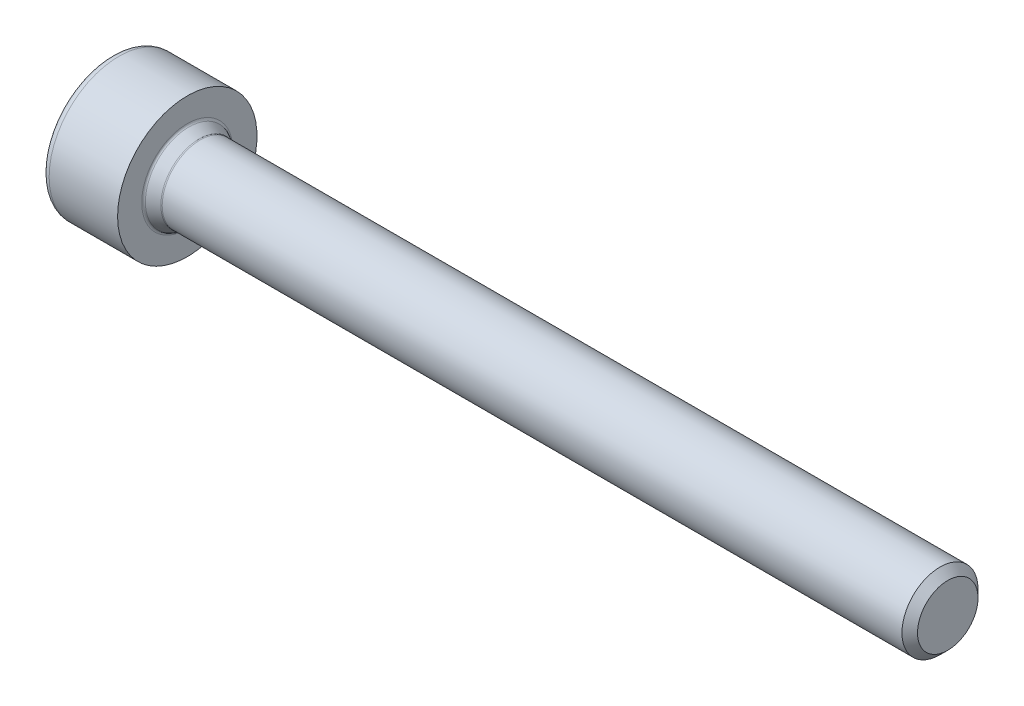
ISO-10303-21;
HEADER;
FILE_DESCRIPTION(('STEP AP214'),'2;1');
FILE_NAME('part.step','',(''),(''),'','','');
FILE_SCHEMA(('AUTOMOTIVE_DESIGN { 1 0 10303 214 1 1 1 1 }'));
ENDSEC;
DATA;
#1=APPLICATION_CONTEXT('core data for automotive mechanical design processes');
#2=APPLICATION_PROTOCOL_DEFINITION('international standard','automotive_design',2000,#1);
#3=PRODUCT_CONTEXT('',#1,'mechanical');
#4=PRODUCT('Part','Part','',(#3));
#5=PRODUCT_RELATED_PRODUCT_CATEGORY('part','',(#4));
#6=PRODUCT_DEFINITION_FORMATION('','',#4);
#7=PRODUCT_DEFINITION_CONTEXT('part definition',#1,'design');
#8=PRODUCT_DEFINITION('design','',#6,#7);
#9=PRODUCT_DEFINITION_SHAPE('','',#8);
#10=(LENGTH_UNIT() NAMED_UNIT(*) SI_UNIT(.MILLI.,.METRE.));
#11=(NAMED_UNIT(*) PLANE_ANGLE_UNIT() SI_UNIT($,.RADIAN.));
#12=(NAMED_UNIT(*) SI_UNIT($,.STERADIAN.) SOLID_ANGLE_UNIT());
#13=UNCERTAINTY_MEASURE_WITH_UNIT(LENGTH_MEASURE(1.E-05),#10,'distance_accuracy_value','');
#14=(GEOMETRIC_REPRESENTATION_CONTEXT(3) GLOBAL_UNCERTAINTY_ASSIGNED_CONTEXT((#13)) GLOBAL_UNIT_ASSIGNED_CONTEXT((#10,
#11,#12)) REPRESENTATION_CONTEXT('',''));
#15=CARTESIAN_POINT('',(0.,0.,0.));
#16=DIRECTION('',(0.,0.,1.));
#17=DIRECTION('',(1.,0.,0.));
#18=AXIS2_PLACEMENT_3D('',#15,#16,#17);
#19=CARTESIAN_POINT('',(-1.15,0.721687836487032,1.25));
#20=DIRECTION('',(0.,0.,1.));
#21=DIRECTION('',(1.,0.,0.));
#22=AXIS2_PLACEMENT_3D('',#19,#20,#21);
#23=PLANE('',#22);
#24=DIRECTION('',(0.,1.,0.));
#25=VECTOR('',#24,1.);
#26=CARTESIAN_POINT('',(-1.15,0.721687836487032,1.25));
#27=LINE('',#26,#25);
#28=CARTESIAN_POINT('',(-1.15,-0.721687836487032,1.25));
#29=VERTEX_POINT('',#28);
#30=CARTESIAN_POINT('',(-1.15,0.721687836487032,1.25));
#31=VERTEX_POINT('',#30);
#32=EDGE_CURVE('E116',#29,#31,#27,.T.);
#33=ORIENTED_EDGE('',*,*,#32,.F.);
#34=DIRECTION('',(1.,0.,0.));
#35=VECTOR('',#34,1.);
#36=CARTESIAN_POINT('',(-1.15,-0.721687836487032,1.25));
#37=LINE('',#36,#35);
#38=CARTESIAN_POINT('',(-3.00000000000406,-0.721687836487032,1.25));
#39=VERTEX_POINT('',#38);
#40=EDGE_CURVE('E114',#29,#39,#37,.F.);
#41=ORIENTED_EDGE('',*,*,#40,.T.);
#42=DIRECTION('',(0.,1.,0.));
#43=VECTOR('',#42,1.);
#44=CARTESIAN_POINT('',(-3.00000000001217,0.721687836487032,1.25));
#45=LINE('',#44,#43);
#46=CARTESIAN_POINT('',(-3.0000000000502,-0.704787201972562,1.25));
#47=VERTEX_POINT('',#46);
#48=EDGE_CURVE('E105',#47,#39,#45,.F.);
#49=ORIENTED_EDGE('',*,*,#48,.F.);
#50=CARTESIAN_POINT('',(-3.00000000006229,0.704787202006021,1.250000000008));
#51=CARTESIAN_POINT('',(-2.97614422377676,0.656175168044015,1.25000000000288));
#52=CARTESIAN_POINT('',(-2.95372895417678,0.606760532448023,1.25000000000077));
#53=CARTESIAN_POINT('',(-2.9127582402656,0.50605678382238,1.24999999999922));
#54=CARTESIAN_POINT('',(-2.89422444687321,0.45475893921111,1.24999999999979));
#55=CARTESIAN_POINT('',(-2.86251893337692,0.35133137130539,1.2500000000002));
#56=CARTESIAN_POINT('',(-2.84927080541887,0.299225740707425,1.25000000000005));
#57=CARTESIAN_POINT('',(-2.82890288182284,0.193916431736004,1.24999999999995));
#58=CARTESIAN_POINT('',(-2.82176877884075,0.140715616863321,1.24999999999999));
#59=CARTESIAN_POINT('',(-2.81531818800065,0.0481901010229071,1.25000000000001));
#60=CARTESIAN_POINT('',(-2.81441787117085,0.00897176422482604,1.25));
#61=CARTESIAN_POINT('',(-2.81631201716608,-0.0693867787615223,1.25));
#62=CARTESIAN_POINT('',(-2.81910735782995,-0.108526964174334,1.25));
#63=CARTESIAN_POINT('',(-2.82823104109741,-0.186418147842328,1.25));
#64=CARTESIAN_POINT('',(-2.83456230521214,-0.225168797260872,1.25));
#65=CARTESIAN_POINT('',(-2.85041837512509,-0.302018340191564,1.25));
#66=CARTESIAN_POINT('',(-2.85994451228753,-0.340116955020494,1.25));
#67=CARTESIAN_POINT('',(-2.88717720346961,-0.434254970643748,1.25));
#68=CARTESIAN_POINT('',(-2.90659584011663,-0.489791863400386,1.25));
#69=CARTESIAN_POINT('',(-2.95013015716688,-0.598801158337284,1.25));
#70=CARTESIAN_POINT('',(-2.9742301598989,-0.652279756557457,1.25));
#71=CARTESIAN_POINT('',(-3.00000000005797,-0.704787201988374,1.25));
#72=B_SPLINE_CURVE_WITH_KNOTS('',3,(#50,#51,#52,#53,#54,#55,#56,#57,#58,#59,#60,#61,#62,#63,#64,
#65,#66,#67,#68,#69,#70,#71),.UNSPECIFIED.,.F.,.F.,(4,2,2,2,2,2,2,2,2,2,4),(0.,
0.162556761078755,0.325997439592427,0.48698151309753,0.647587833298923,0.765107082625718,
0.88265425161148,1.00029868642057,1.11799220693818,1.29422884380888,1.46988514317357),.UNSPECIFIED.);
#73=CARTESIAN_POINT('',(-3.00000000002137,0.704787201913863,1.25));
#74=VERTEX_POINT('',#73);
#75=EDGE_CURVE('E21',#74,#47,#72,.T.);
#76=ORIENTED_EDGE('',*,*,#75,.F.);
#77=DIRECTION('',(0.,1.,0.));
#78=VECTOR('',#77,1.);
#79=CARTESIAN_POINT('',(-3.,0.721687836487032,1.25));
#80=LINE('',#79,#78);
#81=CARTESIAN_POINT('',(-3.00000000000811,0.721687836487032,1.25));
#82=VERTEX_POINT('',#81);
#83=EDGE_CURVE('E96',#82,#74,#80,.F.);
#84=ORIENTED_EDGE('',*,*,#83,.F.);
#85=DIRECTION('',(1.,0.,0.));
#86=VECTOR('',#85,1.);
#87=CARTESIAN_POINT('',(-1.15,0.721687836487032,1.25));
#88=LINE('',#87,#86);
#89=EDGE_CURVE('E131',#82,#31,#88,.T.);
#90=ORIENTED_EDGE('',*,*,#89,.T.);
#91=EDGE_LOOP('',(#33,#41,#49,#76,#84,#90));
#92=FACE_BOUND('',#91,.T.);
#93=ADVANCED_FACE('F17',(#92),#23,.F.);
#94=CARTESIAN_POINT('',(-1.15,1.44337567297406,0.));
#95=DIRECTION('',(0.,0.866025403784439,0.5));
#96=DIRECTION('',(0.,-0.5,0.866025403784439));
#97=AXIS2_PLACEMENT_3D('',#94,#95,#96);
#98=PLANE('',#97);
#99=DIRECTION('',(0.,-0.5,0.866025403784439));
#100=VECTOR('',#99,1.);
#101=CARTESIAN_POINT('',(-1.15,1.44337567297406,0.));
#102=LINE('',#101,#100);
#103=CARTESIAN_POINT('',(-1.15,1.44337567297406,0.));
#104=VERTEX_POINT('',#103);
#105=EDGE_CURVE('E134',#31,#104,#102,.F.);
#106=ORIENTED_EDGE('',*,*,#105,.F.);
#107=ORIENTED_EDGE('',*,*,#89,.F.);
#108=DIRECTION('',(0.,-0.5,0.866025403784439));
#109=VECTOR('',#108,1.);
#110=CARTESIAN_POINT('',(-3.00000000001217,1.44337567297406,0.));
#111=LINE('',#110,#109);
#112=CARTESIAN_POINT('',(-3.0000000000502,0.730138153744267,1.23536362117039));
#113=VERTEX_POINT('',#112);
#114=EDGE_CURVE('E135',#113,#82,#111,.T.);
#115=ORIENTED_EDGE('',*,*,#114,.F.);
#116=CARTESIAN_POINT('',(-3.00000000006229,1.43492535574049,0.0146363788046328));
#117=CARTESIAN_POINT('',(-2.97614422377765,1.41061933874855,0.0567356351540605));
#118=CARTESIAN_POINT('',(-2.9537289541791,1.38591202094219,0.0995299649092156));
#119=CARTESIAN_POINT('',(-2.91275824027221,1.33556014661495,0.18674196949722));
#120=CARTESIAN_POINT('',(-2.89422444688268,1.30991122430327,0.231167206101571));
#121=CARTESIAN_POINT('',(-2.86251893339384,1.25819744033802,0.320738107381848));
#122=CARTESIAN_POINT('',(-2.84927080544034,1.2321446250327,0.365862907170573));
#123=CARTESIAN_POINT('',(-2.82890288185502,1.17948997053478,0.45706344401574));
#124=CARTESIAN_POINT('',(-2.8217687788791,1.15288956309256,0.503136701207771));
#125=CARTESIAN_POINT('',(-2.81531818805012,1.10662680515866,0.583266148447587));
#126=CARTESIAN_POINT('',(-2.81441787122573,1.08701763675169,0.61723022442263));
#127=CARTESIAN_POINT('',(-2.81631201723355,1.04783836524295,0.685090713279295));
#128=CARTESIAN_POINT('',(-2.81910735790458,1.02826827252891,0.718987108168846));
#129=CARTESIAN_POINT('',(-2.82823104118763,0.989322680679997,0.786442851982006));
#130=CARTESIAN_POINT('',(-2.83456230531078,0.969947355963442,0.820001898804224));
#131=CARTESIAN_POINT('',(-2.85041837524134,0.931522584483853,0.886555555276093));
#132=CARTESIAN_POINT('',(-2.85994451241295,0.91247327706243,0.919549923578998));
#133=CARTESIAN_POINT('',(-2.88717720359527,0.86540426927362,1.00107583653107));
#134=CARTESIAN_POINT('',(-2.90659584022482,0.837635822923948,1.04917219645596));
#135=CARTESIAN_POINT('',(-2.95013015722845,0.783131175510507,1.14357701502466));
#136=CARTESIAN_POINT('',(-2.97423015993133,0.756391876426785,1.18989083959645));
#137=CARTESIAN_POINT('',(-3.00000000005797,0.730138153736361,1.23536362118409));
#138=B_SPLINE_CURVE_WITH_KNOTS('',3,(#116,#117,#118,#119,#120,#121,#122,#123,#124,#125,#126,
#127,#128,#129,#130,#131,#132,#133,#134,#135,#136,#137),.UNSPECIFIED.,.F.,.F.,(4,2,2,2,2,2,2,2,
2,2,4),(0.,0.162556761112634,0.325997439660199,0.486981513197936,0.647587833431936,
0.765107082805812,0.882654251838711,1.00029868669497,1.11799220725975,1.29422884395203,
1.46988514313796),.UNSPECIFIED.);
#139=CARTESIAN_POINT('',(-3.00000000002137,1.43492535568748,0.0146363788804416));
#140=VERTEX_POINT('',#139);
#141=EDGE_CURVE('E232',#140,#113,#138,.T.);
#142=ORIENTED_EDGE('',*,*,#141,.F.);
#143=DIRECTION('',(0.,-0.5,0.866025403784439));
#144=VECTOR('',#143,1.);
#145=CARTESIAN_POINT('',(-3.,1.44337567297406,0.));
#146=LINE('',#145,#144);
#147=CARTESIAN_POINT('',(-3.00000000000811,1.44337567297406,0.));
#148=VERTEX_POINT('',#147);
#149=EDGE_CURVE('E118',#148,#140,#146,.T.);
#150=ORIENTED_EDGE('',*,*,#149,.F.);
#151=DIRECTION('',(1.,0.,0.));
#152=VECTOR('',#151,1.);
#153=CARTESIAN_POINT('',(-1.15,1.44337567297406,0.));
#154=LINE('',#153,#152);
#155=EDGE_CURVE('E275',#148,#104,#154,.T.);
#156=ORIENTED_EDGE('',*,*,#155,.T.);
#157=EDGE_LOOP('',(#106,#107,#115,#142,#150,#156));
#158=FACE_BOUND('',#157,.T.);
#159=ADVANCED_FACE('F227',(#158),#98,.F.);
#160=CARTESIAN_POINT('',(-1.15000000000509,0.,0.));
#161=DIRECTION('',(-1.,0.,0.));
#162=DIRECTION('',(0.,0.,1.));
#163=AXIS2_PLACEMENT_3D('',#160,#161,#162);
#164=CONICAL_SURFACE('',#163,1.19047619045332,1.04719755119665);
#165=CARTESIAN_POINT('',(-0.462678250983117,0.,0.));
#166=VERTEX_POINT('',#165);
#167=VERTEX_LOOP('',#166);
#168=FACE_BOUND('',#167,.T.);
#169=CARTESIAN_POINT('',(-1.15000000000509,0.,0.));
#170=DIRECTION('',(-1.,0.,0.));
#171=DIRECTION('',(0.,0.,1.));
#172=AXIS2_PLACEMENT_3D('',#169,#170,#171);
#173=CIRCLE('',#172,1.19047619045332);
#174=CARTESIAN_POINT('',(-1.15000000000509,0.,1.19047619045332));
#175=VERTEX_POINT('',#174);
#176=EDGE_CURVE('E182',#175,#175,#173,.F.);
#177=ORIENTED_EDGE('',*,*,#176,.F.);
#178=EDGE_LOOP('',(#177));
#179=FACE_BOUND('',#178,.T.);
#180=ADVANCED_FACE('F224',(#168,#179),#164,.F.);
#181=CARTESIAN_POINT('',(-1.15,-0.721687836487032,1.25));
#182=DIRECTION('',(0.,-0.866025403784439,0.5));
#183=DIRECTION('',(0.,-0.5,-0.866025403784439));
#184=AXIS2_PLACEMENT_3D('',#181,#182,#183);
#185=PLANE('',#184);
#186=DIRECTION('',(0.,0.5,0.866025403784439));
#187=VECTOR('',#186,1.);
#188=CARTESIAN_POINT('',(-1.15,-1.44337567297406,0.));
#189=LINE('',#188,#187);
#190=CARTESIAN_POINT('',(-1.15,-1.44337567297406,0.));
#191=VERTEX_POINT('',#190);
#192=EDGE_CURVE('E260',#191,#29,#189,.T.);
#193=ORIENTED_EDGE('',*,*,#192,.F.);
#194=DIRECTION('',(1.,0.,0.));
#195=VECTOR('',#194,1.);
#196=CARTESIAN_POINT('',(-1.15,-1.44337567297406,0.));
#197=LINE('',#196,#195);
#198=CARTESIAN_POINT('',(-3.00000000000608,-1.44337567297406,0.));
#199=VERTEX_POINT('',#198);
#200=EDGE_CURVE('E174',#191,#199,#197,.F.);
#201=ORIENTED_EDGE('',*,*,#200,.T.);
#202=DIRECTION('',(0.,-0.5,-0.866025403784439));
#203=VECTOR('',#202,1.);
#204=CARTESIAN_POINT('',(-3.00000000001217,-0.721687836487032,1.25));
#205=LINE('',#204,#203);
#206=CARTESIAN_POINT('',(-3.0000000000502,-1.43492535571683,0.0146363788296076));
#207=VERTEX_POINT('',#206);
#208=EDGE_CURVE('E253',#207,#199,#205,.T.);
#209=ORIENTED_EDGE('',*,*,#208,.F.);
#210=CARTESIAN_POINT('',(-3.00000000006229,-0.73013815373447,1.23536362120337));
#211=CARTESIAN_POINT('',(-2.97614422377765,-0.754444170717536,1.19326436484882));
#212=CARTESIAN_POINT('',(-2.9537289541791,-0.779151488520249,1.15047003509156));
#213=CARTESIAN_POINT('',(-2.91275824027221,-0.829503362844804,1.063258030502));
#214=CARTESIAN_POINT('',(-2.89422444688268,-0.855152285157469,1.01883279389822));
#215=CARTESIAN_POINT('',(-2.86251893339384,-0.906866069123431,0.929261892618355));
#216=CARTESIAN_POINT('',(-2.84927080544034,-0.932918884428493,0.88413709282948));
#217=CARTESIAN_POINT('',(-2.82890288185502,-0.985573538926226,0.792936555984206));
#218=CARTESIAN_POINT('',(-2.8217687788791,-1.01217394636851,0.746863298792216));
#219=CARTESIAN_POINT('',(-2.81531818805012,-1.05843670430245,0.666733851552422));
#220=CARTESIAN_POINT('',(-2.81441787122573,-1.07804587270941,0.632769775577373));
#221=CARTESIAN_POINT('',(-2.81631201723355,-1.11722514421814,0.564909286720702));
#222=CARTESIAN_POINT('',(-2.81910735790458,-1.13679523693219,0.531012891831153));
#223=CARTESIAN_POINT('',(-2.82823104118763,-1.1757408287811,0.463557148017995));
#224=CARTESIAN_POINT('',(-2.83456230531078,-1.19511615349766,0.429998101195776));
#225=CARTESIAN_POINT('',(-2.85041837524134,-1.23354092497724,0.363444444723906));
#226=CARTESIAN_POINT('',(-2.85994451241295,-1.25259023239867,0.330450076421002));
#227=CARTESIAN_POINT('',(-2.88717720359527,-1.29965924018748,0.248924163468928));
#228=CARTESIAN_POINT('',(-2.90659584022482,-1.32742768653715,0.200827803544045));
#229=CARTESIAN_POINT('',(-2.95013015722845,-1.38193233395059,0.106422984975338));
#230=CARTESIAN_POINT('',(-2.97423015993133,-1.40867163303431,0.0601091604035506));
#231=CARTESIAN_POINT('',(-3.00000000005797,-1.43492535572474,0.0146363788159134));
#232=B_SPLINE_CURVE_WITH_KNOTS('',3,(#210,#211,#212,#213,#214,#215,#216,#217,#218,#219,#220,
#221,#222,#223,#224,#225,#226,#227,#228,#229,#230,#231),.UNSPECIFIED.,.F.,.F.,(4,2,2,2,2,2,2,2,
2,2,4),(0.,0.162556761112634,0.325997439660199,0.486981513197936,0.647587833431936,
0.765107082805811,0.882654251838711,1.00029868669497,1.11799220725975,1.29422884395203,
1.46988514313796),.UNSPECIFIED.);
#233=CARTESIAN_POINT('',(-3.00000000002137,-0.730138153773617,1.23536362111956));
#234=VERTEX_POINT('',#233);
#235=EDGE_CURVE('E210',#234,#207,#232,.T.);
#236=ORIENTED_EDGE('',*,*,#235,.F.);
#237=DIRECTION('',(0.,-0.5,-0.866025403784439));
#238=VECTOR('',#237,1.);
#239=CARTESIAN_POINT('',(-3.,-0.721687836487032,1.25));
#240=LINE('',#239,#238);
#241=EDGE_CURVE('E246',#39,#234,#240,.T.);
#242=ORIENTED_EDGE('',*,*,#241,.F.);
#243=ORIENTED_EDGE('',*,*,#40,.F.);
#244=EDGE_LOOP('',(#193,#201,#209,#236,#242,#243));
#245=FACE_BOUND('',#244,.T.);
#246=ADVANCED_FACE('F220',(#245),#185,.F.);
#247=CARTESIAN_POINT('',(-1.15,0.721687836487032,-1.25));
#248=DIRECTION('',(0.,0.866025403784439,-0.5));
#249=DIRECTION('',(0.,0.5,0.866025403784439));
#250=AXIS2_PLACEMENT_3D('',#247,#248,#249);
#251=PLANE('',#250);
#252=DIRECTION('',(0.,-0.5,-0.866025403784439));
#253=VECTOR('',#252,1.);
#254=CARTESIAN_POINT('',(-1.15,1.44337567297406,0.));
#255=LINE('',#254,#253);
#256=CARTESIAN_POINT('',(-1.15,0.721687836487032,-1.25));
#257=VERTEX_POINT('',#256);
#258=EDGE_CURVE('E264',#104,#257,#255,.T.);
#259=ORIENTED_EDGE('',*,*,#258,.F.);
#260=ORIENTED_EDGE('',*,*,#155,.F.);
#261=DIRECTION('',(0.,0.5,0.866025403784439));
#262=VECTOR('',#261,1.);
#263=CARTESIAN_POINT('',(-3.00000000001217,0.721687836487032,-1.25));
#264=LINE('',#263,#262);
#265=CARTESIAN_POINT('',(-3.0000000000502,1.43492535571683,-0.0146363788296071));
#266=VERTEX_POINT('',#265);
#267=EDGE_CURVE('E277',#266,#148,#264,.T.);
#268=ORIENTED_EDGE('',*,*,#267,.F.);
#269=CARTESIAN_POINT('',(-3.00426157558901,0.725819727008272,-1.2428433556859));
#270=CARTESIAN_POINT('',(-2.97994040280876,0.750374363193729,-1.20031347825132));
#271=CARTESIAN_POINT('',(-2.95706698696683,0.775336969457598,-1.15707697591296));
#272=CARTESIAN_POINT('',(-2.91522055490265,0.826223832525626,-1.06893834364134));
#273=CARTESIAN_POINT('',(-2.89627023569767,0.852152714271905,-1.02402820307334));
#274=CARTESIAN_POINT('',(-2.86382230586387,0.904441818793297,-0.933460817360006));
#275=CARTESIAN_POINT('',(-2.85024637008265,0.930789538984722,-0.887825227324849));
#276=CARTESIAN_POINT('',(-2.82935010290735,0.984052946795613,-0.795570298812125));
#277=CARTESIAN_POINT('',(-2.82201463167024,1.01096709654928,-0.748953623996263));
#278=CARTESIAN_POINT('',(-2.81538646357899,1.05755873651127,-0.668254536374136));
#279=CARTESIAN_POINT('',(-2.81443064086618,1.07717930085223,-0.634270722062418));
#280=CARTESIAN_POINT('',(-2.81621905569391,1.11638378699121,-0.566366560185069));
#281=CARTESIAN_POINT('',(-2.81896414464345,1.13596769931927,-0.5324462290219));
#282=CARTESIAN_POINT('',(-2.82799496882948,1.17494091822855,-0.464942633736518));
#283=CARTESIAN_POINT('',(-2.83428330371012,1.19433007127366,-0.431359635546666));
#284=CARTESIAN_POINT('',(-2.85006218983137,1.23278348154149,-0.364756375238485));
#285=CARTESIAN_POINT('',(-2.85955407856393,1.25184759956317,-0.331736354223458));
#286=CARTESIAN_POINT('',(-2.88677246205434,1.29905861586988,-0.249964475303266));
#287=CARTESIAN_POINT('',(-2.90623945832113,1.32695097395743,-0.201653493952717));
#288=CARTESIAN_POINT('',(-2.94991978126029,1.38169884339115,-0.106827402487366));
#289=CARTESIAN_POINT('',(-2.97411794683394,1.40855734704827,-0.0603071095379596));
#290=CARTESIAN_POINT('',(-3.00000000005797,1.43492535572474,-0.01463637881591));
#291=B_SPLINE_CURVE_WITH_KNOTS('',3,(#269,#270,#271,#272,#273,#274,#275,#276,#277,#278,#279,
#280,#281,#282,#283,#284,#285,#286,#287,#288,#289,#290),.UNSPECIFIED.,.F.,.F.,(4,2,2,2,2,2,2,2,
2,2,4),(0.,0.164516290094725,0.329959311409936,0.492893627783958,0.655431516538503,
0.773023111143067,0.890641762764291,1.00834682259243,1.12610108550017,1.30308323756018,
1.47950727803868),.UNSPECIFIED.);
#292=CARTESIAN_POINT('',(-3.00000000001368,0.72255762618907,-1.24340839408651));
#293=VERTEX_POINT('',#292);
#294=EDGE_CURVE('E40',#293,#266,#291,.T.);
#295=ORIENTED_EDGE('',*,*,#294,.F.);
#296=DIRECTION('',(1.,0.,0.));
#297=VECTOR('',#296,1.);
#298=CARTESIAN_POINT('',(-1.15,0.721687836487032,-1.25));
#299=LINE('',#298,#297);
#300=EDGE_CURVE('E167',#293,#257,#299,.T.);
#301=ORIENTED_EDGE('',*,*,#300,.T.);
#302=EDGE_LOOP('',(#259,#260,#268,#295,#301));
#303=FACE_BOUND('',#302,.T.);
#304=ADVANCED_FACE('F216',(#303),#251,.F.);
#305=CARTESIAN_POINT('',(-1.15,0.,0.));
#306=DIRECTION('',(-1.,0.,0.));
#307=DIRECTION('',(0.,0.,1.));
#308=AXIS2_PLACEMENT_3D('',#305,#306,#307);
#309=PLANE('',#308);
#310=DIRECTION('',(0.,0.5,-0.866025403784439));
#311=VECTOR('',#310,1.);
#312=CARTESIAN_POINT('',(-1.15,-1.44337567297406,0.));
#313=LINE('',#312,#311);
#314=CARTESIAN_POINT('',(-1.15,-0.721687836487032,-1.25));
#315=VERTEX_POINT('',#314);
#316=EDGE_CURVE('E269',#315,#191,#313,.F.);
#317=ORIENTED_EDGE('',*,*,#316,.T.);
#318=ORIENTED_EDGE('',*,*,#192,.T.);
#319=ORIENTED_EDGE('',*,*,#32,.T.);
#320=ORIENTED_EDGE('',*,*,#105,.T.);
#321=ORIENTED_EDGE('',*,*,#258,.T.);
#322=DIRECTION('',(0.,1.,0.));
#323=VECTOR('',#322,1.);
#324=CARTESIAN_POINT('',(-1.15,-0.721687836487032,-1.25));
#325=LINE('',#324,#323);
#326=EDGE_CURVE('E164',#257,#315,#325,.F.);
#327=ORIENTED_EDGE('',*,*,#326,.T.);
#328=EDGE_LOOP('',(#317,#318,#319,#320,#321,#327));
#329=FACE_BOUND('',#328,.T.);
#330=ORIENTED_EDGE('',*,*,#176,.T.);
#331=EDGE_LOOP('',(#330));
#332=FACE_BOUND('',#331,.T.);
#333=ADVANCED_FACE('F219',(#329,#332),#309,.T.);
#334=CARTESIAN_POINT('',(-1.15,-1.44337567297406,0.));
#335=DIRECTION('',(0.,-0.866025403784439,-0.5));
#336=DIRECTION('',(0.,0.5,-0.866025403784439));
#337=AXIS2_PLACEMENT_3D('',#334,#335,#336);
#338=PLANE('',#337);
#339=ORIENTED_EDGE('',*,*,#316,.F.);
#340=DIRECTION('',(-1.,0.,0.));
#341=VECTOR('',#340,1.);
#342=CARTESIAN_POINT('',(-1.15,-0.721687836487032,-1.25));
#343=LINE('',#342,#341);
#344=CARTESIAN_POINT('',(-2.9999948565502,-0.723123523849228,-1.24341158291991));
#345=VERTEX_POINT('',#344);
#346=EDGE_CURVE('E159',#315,#345,#343,.T.);
#347=ORIENTED_EDGE('',*,*,#346,.T.);
#348=CARTESIAN_POINT('',(-3.00414964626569,-0.725932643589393,-1.24264777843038));
#349=CARTESIAN_POINT('',(-2.97984074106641,-0.750480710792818,-1.20012927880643));
#350=CARTESIAN_POINT('',(-2.95697940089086,-0.775436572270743,-1.15690445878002));
#351=CARTESIAN_POINT('',(-2.91515604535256,-0.826309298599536,-1.068790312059));
#352=CARTESIAN_POINT('',(-2.896216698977,-0.852230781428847,-1.02389298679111));
#353=CARTESIAN_POINT('',(-2.8637883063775,-0.904504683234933,-0.933351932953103));
#354=CARTESIAN_POINT('',(-2.8502209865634,-0.930844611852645,-0.887729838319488));
#355=CARTESIAN_POINT('',(-2.82933856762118,-0.984091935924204,-0.795502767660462));
#356=CARTESIAN_POINT('',(-2.82200835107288,-1.01099779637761,-0.748900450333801));
#357=CARTESIAN_POINT('',(-2.81538472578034,-1.05758072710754,-0.6682164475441));
#358=CARTESIAN_POINT('',(-2.81443029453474,-1.07720097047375,-0.634233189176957));
#359=CARTESIAN_POINT('',(-2.81622134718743,-1.11640475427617,-0.566330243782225));
#360=CARTESIAN_POINT('',(-2.8189676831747,-1.13598828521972,-0.532410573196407));
#361=CARTESIAN_POINT('',(-2.82800079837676,-1.17496074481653,-0.464908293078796));
#362=CARTESIAN_POINT('',(-2.83429018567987,-1.19434951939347,-0.431325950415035));
#363=CARTESIAN_POINT('',(-2.85007095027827,-1.2328021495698,-0.364724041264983));
#364=CARTESIAN_POINT('',(-2.85956366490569,-1.25186586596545,-0.331704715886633));
#365=CARTESIAN_POINT('',(-2.88678238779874,-1.2990733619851,-0.249938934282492));
#366=CARTESIAN_POINT('',(-2.90624820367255,-1.32696268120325,-0.201633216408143));
#367=CARTESIAN_POINT('',(-2.94992494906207,-1.38170458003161,-0.106817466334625));
#368=CARTESIAN_POINT('',(-2.97412070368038,-1.40856015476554,-0.0603022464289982));
#369=CARTESIAN_POINT('',(-3.0000000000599,-1.4349253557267,-0.0146363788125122));
#370=B_SPLINE_CURVE_WITH_KNOTS('',3,(#348,#349,#350,#351,#352,#353,#354,#355,#356,#357,#358,
#359,#360,#361,#362,#363,#364,#365,#366,#367,#368,#369),.UNSPECIFIED.,.F.,.F.,(4,2,2,2,2,2,2,2,
2,2,4),(0.,0.16446452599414,0.329854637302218,0.492737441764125,0.655224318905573,
0.772813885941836,0.890430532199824,1.00813387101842,1.12588640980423,1.30285028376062,
1.47925546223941),.UNSPECIFIED.);
#371=CARTESIAN_POINT('',(-3.00000000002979,-1.43492535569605,-0.0146363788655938));
#372=VERTEX_POINT('',#371);
#373=EDGE_CURVE('E169',#345,#372,#370,.T.);
#374=ORIENTED_EDGE('',*,*,#373,.T.);
#375=DIRECTION('',(0.,0.5,-0.866025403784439));
#376=VECTOR('',#375,1.);
#377=CARTESIAN_POINT('',(-3.,-1.44337567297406,0.));
#378=LINE('',#377,#376);
#379=EDGE_CURVE('E263',#199,#372,#378,.T.);
#380=ORIENTED_EDGE('',*,*,#379,.F.);
#381=ORIENTED_EDGE('',*,*,#200,.F.);
#382=EDGE_LOOP('',(#339,#347,#374,#380,#381));
#383=FACE_BOUND('',#382,.T.);
#384=ADVANCED_FACE('F184',(#383),#338,.F.);
#385=CARTESIAN_POINT('',(-3.00000000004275,0.,0.));
#386=DIRECTION('',(-1.,0.,0.));
#387=DIRECTION('',(0.,-1.,0.));
#388=AXIS2_PLACEMENT_3D('',#385,#386,#387);
#389=CONICAL_SURFACE('',#388,1.43500000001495,0.785398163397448);
#390=CARTESIAN_POINT('',(-3.00000000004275,0.,0.));
#391=DIRECTION('',(-1.,0.,0.));
#392=DIRECTION('',(0.,-1.,0.));
#393=AXIS2_PLACEMENT_3D('',#390,#391,#392);
#394=CIRCLE('',#393,1.43500000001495);
#395=EDGE_CURVE('E157',#372,#345,#394,.F.);
#396=ORIENTED_EDGE('',*,*,#395,.F.);
#397=ORIENTED_EDGE('',*,*,#373,.F.);
#398=EDGE_LOOP('',(#396,#397));
#399=FACE_BOUND('',#398,.T.);
#400=ADVANCED_FACE('F187',(#399),#389,.F.);
#401=CARTESIAN_POINT('',(-1.15,-0.721687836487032,-1.25));
#402=DIRECTION('',(0.,0.,-1.));
#403=DIRECTION('',(-1.,0.,0.));
#404=AXIS2_PLACEMENT_3D('',#401,#402,#403);
#405=PLANE('',#404);
#406=ORIENTED_EDGE('',*,*,#326,.F.);
#407=ORIENTED_EDGE('',*,*,#300,.F.);
#408=DIRECTION('',(0.,1.,0.));
#409=VECTOR('',#408,1.);
#410=CARTESIAN_POINT('',(-3.,0.,-1.25000000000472));
#411=LINE('',#410,#409);
#412=EDGE_CURVE('E154',#345,#293,#411,.T.);
#413=ORIENTED_EDGE('',*,*,#412,.F.);
#414=ORIENTED_EDGE('',*,*,#346,.F.);
#415=EDGE_LOOP('',(#406,#407,#413,#414));
#416=FACE_BOUND('',#415,.T.);
#417=ADVANCED_FACE('F191',(#416),#405,.F.);
#418=CARTESIAN_POINT('',(-3.00000000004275,0.,0.));
#419=DIRECTION('',(-1.,0.,0.));
#420=DIRECTION('',(0.,-1.,0.));
#421=AXIS2_PLACEMENT_3D('',#418,#419,#420);
#422=CONICAL_SURFACE('',#421,1.43500000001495,0.785398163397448);
#423=CARTESIAN_POINT('',(-3.00000000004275,0.,0.));
#424=DIRECTION('',(-1.,0.,0.));
#425=DIRECTION('',(0.,-1.,0.));
#426=AXIS2_PLACEMENT_3D('',#423,#424,#425);
#427=CIRCLE('',#426,1.43500000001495);
#428=EDGE_CURVE('E151',#293,#266,#427,.F.);
#429=ORIENTED_EDGE('',*,*,#428,.F.);
#430=ORIENTED_EDGE('',*,*,#294,.T.);
#431=EDGE_LOOP('',(#429,#430));
#432=FACE_BOUND('',#431,.T.);
#433=ADVANCED_FACE('F195',(#432),#422,.F.);
#434=CARTESIAN_POINT('',(-3.00000000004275,0.,0.));
#435=DIRECTION('',(-1.,0.,0.));
#436=DIRECTION('',(0.,-1.,0.));
#437=AXIS2_PLACEMENT_3D('',#434,#435,#436);
#438=CONICAL_SURFACE('',#437,1.43500000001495,0.785398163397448);
#439=CARTESIAN_POINT('',(-3.00000000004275,0.,0.));
#440=DIRECTION('',(-1.,0.,0.));
#441=DIRECTION('',(0.,-1.,0.));
#442=AXIS2_PLACEMENT_3D('',#439,#440,#441);
#443=CIRCLE('',#442,1.43500000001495);
#444=EDGE_CURVE('E111',#140,#113,#443,.F.);
#445=ORIENTED_EDGE('',*,*,#444,.F.);
#446=ORIENTED_EDGE('',*,*,#141,.T.);
#447=EDGE_LOOP('',(#445,#446));
#448=FACE_BOUND('',#447,.T.);
#449=ADVANCED_FACE('F200',(#448),#438,.F.);
#450=CARTESIAN_POINT('',(-3.00000000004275,0.,0.));
#451=DIRECTION('',(-1.,0.,0.));
#452=DIRECTION('',(0.,-1.,0.));
#453=AXIS2_PLACEMENT_3D('',#450,#451,#452);
#454=CONICAL_SURFACE('',#453,1.43500000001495,0.785398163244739);
#455=CARTESIAN_POINT('',(-3.00000000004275,0.,0.));
#456=DIRECTION('',(-1.,0.,0.));
#457=DIRECTION('',(0.,-1.,0.));
#458=AXIS2_PLACEMENT_3D('',#455,#456,#457);
#459=CIRCLE('',#458,1.43500000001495);
#460=EDGE_CURVE('E102',#74,#47,#459,.F.);
#461=ORIENTED_EDGE('',*,*,#460,.F.);
#462=ORIENTED_EDGE('',*,*,#75,.T.);
#463=EDGE_LOOP('',(#461,#462));
#464=FACE_BOUND('',#463,.T.);
#465=ADVANCED_FACE('F101',(#464),#454,.F.);
#466=CARTESIAN_POINT('',(-3.00000000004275,0.,0.));
#467=DIRECTION('',(-1.,0.,0.));
#468=DIRECTION('',(0.,-1.,0.));
#469=AXIS2_PLACEMENT_3D('',#466,#467,#468);
#470=CONICAL_SURFACE('',#469,1.43500000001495,0.785398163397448);
#471=CARTESIAN_POINT('',(-3.00000000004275,0.,0.));
#472=DIRECTION('',(-1.,0.,0.));
#473=DIRECTION('',(0.,-1.,0.));
#474=AXIS2_PLACEMENT_3D('',#471,#472,#473);
#475=CIRCLE('',#474,1.43500000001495);
#476=EDGE_CURVE('E110',#234,#207,#475,.F.);
#477=ORIENTED_EDGE('',*,*,#476,.F.);
#478=ORIENTED_EDGE('',*,*,#235,.T.);
#479=EDGE_LOOP('',(#477,#478));
#480=FACE_BOUND('',#479,.T.);
#481=ADVANCED_FACE('F326',(#480),#470,.F.);
#482=CARTESIAN_POINT('',(-3.,0.,-1.9425));
#483=DIRECTION('',(-1.,0.,0.));
#484=DIRECTION('',(0.,0.,1.));
#485=AXIS2_PLACEMENT_3D('',#482,#483,#484);
#486=PLANE('',#485);
#487=ORIENTED_EDGE('',*,*,#476,.T.);
#488=ORIENTED_EDGE('',*,*,#208,.T.);
#489=ORIENTED_EDGE('',*,*,#379,.T.);
#490=ORIENTED_EDGE('',*,*,#395,.T.);
#491=ORIENTED_EDGE('',*,*,#412,.T.);
#492=ORIENTED_EDGE('',*,*,#428,.T.);
#493=ORIENTED_EDGE('',*,*,#267,.T.);
#494=ORIENTED_EDGE('',*,*,#149,.T.);
#495=ORIENTED_EDGE('',*,*,#444,.T.);
#496=ORIENTED_EDGE('',*,*,#114,.T.);
#497=ORIENTED_EDGE('',*,*,#83,.T.);
#498=ORIENTED_EDGE('',*,*,#460,.T.);
#499=ORIENTED_EDGE('',*,*,#48,.T.);
#500=ORIENTED_EDGE('',*,*,#241,.T.);
#501=EDGE_LOOP('',(#487,#488,#489,#490,#491,#492,#493,#494,#495,#496,#497,#498,#499,#500));
#502=FACE_BOUND('',#501,.T.);
#503=CARTESIAN_POINT('',(-3.,0.,0.));
#504=DIRECTION('',(1.,0.,0.));
#505=DIRECTION('',(0.,0.,1.));
#506=AXIS2_PLACEMENT_3D('',#503,#504,#505);
#507=CIRCLE('',#506,2.44999999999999);
#508=CARTESIAN_POINT('',(-3.,0.,2.44999999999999));
#509=VERTEX_POINT('',#508);
#510=EDGE_CURVE('E147',#509,#509,#507,.T.);
#511=ORIENTED_EDGE('',*,*,#510,.F.);
#512=EDGE_LOOP('',(#511));
#513=FACE_BOUND('',#512,.T.);
#514=ADVANCED_FACE('F107',(#502,#513),#486,.T.);
#515=CARTESIAN_POINT('',(-2.69999999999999,0.,0.));
#516=DIRECTION('',(-1.,0.,0.));
#517=DIRECTION('',(0.,0.,1.));
#518=AXIS2_PLACEMENT_3D('',#515,#516,#517);
#519=TOROIDAL_SURFACE('',#518,2.44999999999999,0.300000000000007);
#520=CARTESIAN_POINT('',(-2.69999999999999,0.,0.));
#521=DIRECTION('',(-1.,0.,0.));
#522=DIRECTION('',(0.,0.,1.));
#523=AXIS2_PLACEMENT_3D('',#520,#521,#522);
#524=CIRCLE('',#523,2.75);
#525=CARTESIAN_POINT('',(-2.69999999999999,0.,2.75));
#526=VERTEX_POINT('',#525);
#527=EDGE_CURVE('E146',#526,#526,#524,.F.);
#528=ORIENTED_EDGE('',*,*,#527,.F.);
#529=EDGE_LOOP('',(#528));
#530=FACE_BOUND('',#529,.T.);
#531=ORIENTED_EDGE('',*,*,#510,.T.);
#532=EDGE_LOOP('',(#531));
#533=FACE_BOUND('',#532,.T.);
#534=ADVANCED_FACE('F393',(#530,#533),#519,.T.);
#535=CARTESIAN_POINT('',(-1.35,0.,0.));
#536=DIRECTION('',(-1.,0.,0.));
#537=DIRECTION('',(0.,0.,1.));
#538=AXIS2_PLACEMENT_3D('',#535,#536,#537);
#539=CYLINDRICAL_SURFACE('',#538,2.75);
#540=CARTESIAN_POINT('',(0.,0.,0.));
#541=DIRECTION('',(-1.,0.,0.));
#542=DIRECTION('',(0.,0.,1.));
#543=AXIS2_PLACEMENT_3D('',#540,#541,#542);
#544=CIRCLE('',#543,2.75);
#545=CARTESIAN_POINT('',(0.,0.,2.75));
#546=VERTEX_POINT('',#545);
#547=EDGE_CURVE('E142',#546,#546,#544,.F.);
#548=ORIENTED_EDGE('',*,*,#547,.F.);
#549=EDGE_LOOP('',(#548));
#550=FACE_BOUND('',#549,.T.);
#551=ORIENTED_EDGE('',*,*,#527,.T.);
#552=EDGE_LOOP('',(#551));
#553=FACE_BOUND('',#552,.T.);
#554=ADVANCED_FACE('F397',(#550,#553),#539,.T.);
#555=CARTESIAN_POINT('',(0.,0.,-2.275));
#556=DIRECTION('',(1.,0.,0.));
#557=DIRECTION('',(0.,0.,-1.));
#558=AXIS2_PLACEMENT_3D('',#555,#556,#557);
#559=PLANE('',#558);
#560=ORIENTED_EDGE('',*,*,#547,.T.);
#561=EDGE_LOOP('',(#560));
#562=FACE_BOUND('',#561,.T.);
#563=CARTESIAN_POINT('',(0.,0.,0.));
#564=DIRECTION('',(1.,0.,0.));
#565=DIRECTION('',(0.,0.,-1.));
#566=AXIS2_PLACEMENT_3D('',#563,#564,#565);
#567=CIRCLE('',#566,1.79999999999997);
#568=CARTESIAN_POINT('',(0.,0.,-1.79999999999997));
#569=VERTEX_POINT('',#568);
#570=EDGE_CURVE('E145',#569,#569,#567,.F.);
#571=ORIENTED_EDGE('',*,*,#570,.T.);
#572=EDGE_LOOP('',(#571));
#573=FACE_BOUND('',#572,.T.);
#574=ADVANCED_FACE('F370',(#562,#573),#559,.T.);
#575=CARTESIAN_POINT('',(0.0999999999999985,0.,0.));
#576=DIRECTION('',(1.,0.,0.));
#577=DIRECTION('',(0.,0.,-1.));
#578=AXIS2_PLACEMENT_3D('',#575,#576,#577);
#579=TOROIDAL_SURFACE('',#578,1.79999999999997,0.0999999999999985);
#580=CARTESIAN_POINT('',(0.0561576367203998,0.,0.));
#581=DIRECTION('',(-1.,0.,0.));
#582=DIRECTION('',(0.,0.,-1.));
#583=AXIS2_PLACEMENT_3D('',#580,#581,#582);
#584=CIRCLE('',#583,1.71012315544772);
#585=CARTESIAN_POINT('',(0.0561576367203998,0.,-1.71012315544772));
#586=VERTEX_POINT('',#585);
#587=EDGE_CURVE('E353',#586,#586,#584,.F.);
#588=ORIENTED_EDGE('',*,*,#587,.F.);
#589=EDGE_LOOP('',(#588));
#590=FACE_BOUND('',#589,.T.);
#591=ORIENTED_EDGE('',*,*,#570,.F.);
#592=EDGE_LOOP('',(#591));
#593=FACE_BOUND('',#592,.T.);
#594=ADVANCED_FACE('F365',(#590,#593),#579,.F.);
#595=CARTESIAN_POINT('',(0.0561576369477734,0.,0.));
#596=DIRECTION('',(-1.,0.,0.));
#597=DIRECTION('',(0.,-1.,0.));
#598=AXIS2_PLACEMENT_3D('',#595,#596,#597);
#599=CONICAL_SURFACE('',#598,1.71012315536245,0.453844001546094);
#600=ORIENTED_EDGE('',*,*,#587,.T.);
#601=EDGE_LOOP('',(#600));
#602=FACE_BOUND('',#601,.T.);
#603=CARTESIAN_POINT('',(0.466157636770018,0.,0.));
#604=DIRECTION('',(1.,0.,0.));
#605=DIRECTION('',(0.,0.,-1.));
#606=AXIS2_PLACEMENT_3D('',#603,#604,#605);
#607=CIRCLE('',#606,1.51012315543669);
#608=CARTESIAN_POINT('',(0.466157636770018,0.,-1.51012315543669));
#609=VERTEX_POINT('',#608);
#610=EDGE_CURVE('E141',#609,#609,#607,.F.);
#611=ORIENTED_EDGE('',*,*,#610,.T.);
#612=EDGE_LOOP('',(#611));
#613=FACE_BOUND('',#612,.T.);
#614=ADVANCED_FACE('F369',(#602,#613),#599,.T.);
#615=CARTESIAN_POINT('',(29.9999999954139,0.,0.));
#616=DIRECTION('',(1.,0.,0.));
#617=DIRECTION('',(0.,0.,-1.));
#618=AXIS2_PLACEMENT_3D('',#615,#616,#617);
#619=PLANE('',#618);
#620=CARTESIAN_POINT('',(29.9999999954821,0.,0.));
#621=DIRECTION('',(-1.,0.,0.));
#622=DIRECTION('',(0.,-1.,0.));
#623=AXIS2_PLACEMENT_3D('',#620,#621,#622);
#624=CIRCLE('',#623,1.19350000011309);
#625=CARTESIAN_POINT('',(29.9999999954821,-1.19350000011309,0.));
#626=VERTEX_POINT('',#625);
#627=EDGE_CURVE('E138',#626,#626,#624,.T.);
#628=ORIENTED_EDGE('',*,*,#627,.F.);
#629=EDGE_LOOP('',(#628));
#630=FACE_BOUND('',#629,.T.);
#631=ADVANCED_FACE('F343',(#630),#619,.T.);
#632=CARTESIAN_POINT('',(0.509999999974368,0.,0.));
#633=DIRECTION('',(1.,0.,0.));
#634=DIRECTION('',(0.,0.,-1.));
#635=AXIS2_PLACEMENT_3D('',#632,#633,#634);
#636=TOROIDAL_SURFACE('',#635,1.6,0.0999999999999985);
#637=CARTESIAN_POINT('',(0.509999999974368,0.,0.));
#638=DIRECTION('',(-1.,0.,0.));
#639=DIRECTION('',(0.,0.,1.));
#640=AXIS2_PLACEMENT_3D('',#637,#638,#639);
#641=CIRCLE('',#640,1.5);
#642=CARTESIAN_POINT('',(0.509999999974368,0.,1.5));
#643=VERTEX_POINT('',#642);
#644=EDGE_CURVE('E31',#643,#643,#641,.F.);
#645=ORIENTED_EDGE('',*,*,#644,.F.);
#646=EDGE_LOOP('',(#645));
#647=FACE_BOUND('',#646,.T.);
#648=ORIENTED_EDGE('',*,*,#610,.F.);
#649=EDGE_LOOP('',(#648));
#650=FACE_BOUND('',#649,.T.);
#651=ADVANCED_FACE('F335',(#647,#650),#636,.F.);
#652=CARTESIAN_POINT('',(29.693499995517,0.,0.));
#653=DIRECTION('',(-1.,0.,0.));
#654=DIRECTION('',(0.,-1.,0.));
#655=AXIS2_PLACEMENT_3D('',#652,#653,#654);
#656=CONICAL_SURFACE('',#655,1.50000000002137,0.785398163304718);
#657=ORIENTED_EDGE('',*,*,#627,.T.);
#658=EDGE_LOOP('',(#657));
#659=FACE_BOUND('',#658,.T.);
#660=CARTESIAN_POINT('',(29.6934999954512,0.,0.));
#661=DIRECTION('',(-1.,0.,0.));
#662=DIRECTION('',(0.,0.,1.));
#663=AXIS2_PLACEMENT_3D('',#660,#661,#662);
#664=CIRCLE('',#663,1.5);
#665=CARTESIAN_POINT('',(29.6934999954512,0.,1.5));
#666=VERTEX_POINT('',#665);
#667=EDGE_CURVE('E11',#666,#666,#664,.T.);
#668=ORIENTED_EDGE('',*,*,#667,.F.);
#669=EDGE_LOOP('',(#668));
#670=FACE_BOUND('',#669,.T.);
#671=ADVANCED_FACE('F329',(#659,#670),#656,.T.);
#672=CARTESIAN_POINT('',(29.9999999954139,0.,0.));
#673=DIRECTION('',(-1.,0.,0.));
#674=DIRECTION('',(0.,0.,1.));
#675=AXIS2_PLACEMENT_3D('',#672,#673,#674);
#676=CYLINDRICAL_SURFACE('',#675,1.5);
#677=ORIENTED_EDGE('',*,*,#667,.T.);
#678=EDGE_LOOP('',(#677));
#679=FACE_BOUND('',#678,.T.);
#680=ORIENTED_EDGE('',*,*,#644,.T.);
#681=EDGE_LOOP('',(#680));
#682=FACE_BOUND('',#681,.T.);
#683=ADVANCED_FACE('F327',(#679,#682),#676,.T.);
#684=CLOSED_SHELL('',(#93,#159,#180,#246,#304,#333,#384,#400,#417,#433,#449,#465,#481,#514,#534,
#554,#574,#594,#614,#631,#651,#671,#683));
#685=MANIFOLD_SOLID_BREP('B1',#684);
#686=ADVANCED_BREP_SHAPE_REPRESENTATION('',(#18,#685),#14);
#687=SHAPE_DEFINITION_REPRESENTATION(#9,#686);
ENDSEC;
END-ISO-10303-21;
